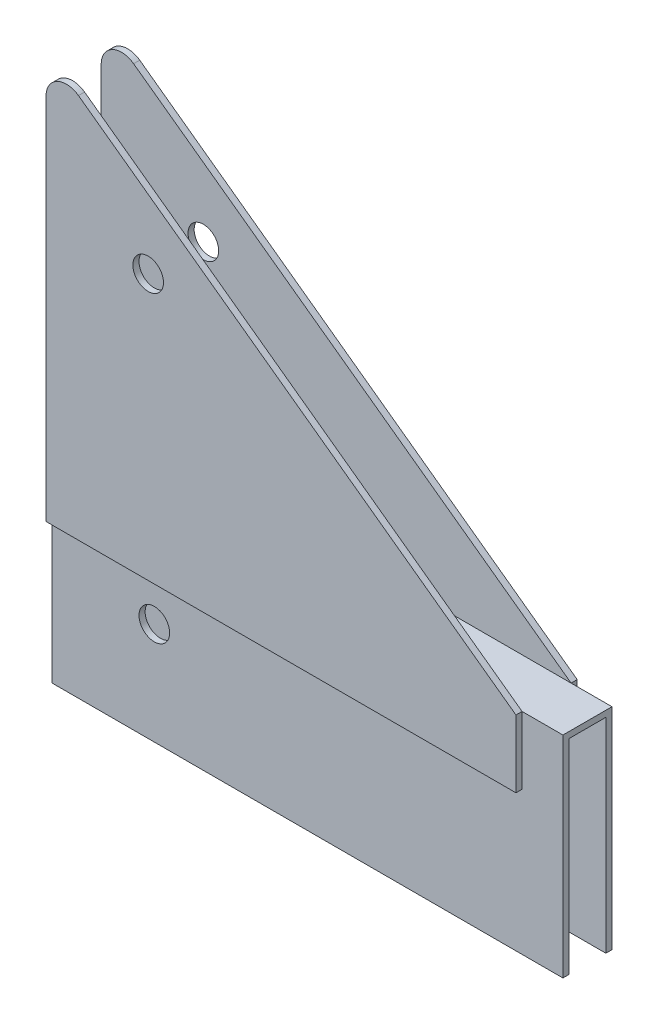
ISO-10303-21;
HEADER;
FILE_DESCRIPTION(('STEP AP214'),'2;1');
FILE_NAME('part.step','',(''),(''),'','','');
FILE_SCHEMA(('AUTOMOTIVE_DESIGN { 1 0 10303 214 1 1 1 1 }'));
ENDSEC;
DATA;
#1=APPLICATION_CONTEXT('core data for automotive mechanical design processes');
#2=APPLICATION_PROTOCOL_DEFINITION('international standard','automotive_design',2000,#1);
#3=PRODUCT_CONTEXT('',#1,'mechanical');
#4=PRODUCT('Part','Part','',(#3));
#5=PRODUCT_RELATED_PRODUCT_CATEGORY('part','',(#4));
#6=PRODUCT_DEFINITION_FORMATION('','',#4);
#7=PRODUCT_DEFINITION_CONTEXT('part definition',#1,'design');
#8=PRODUCT_DEFINITION('design','',#6,#7);
#9=PRODUCT_DEFINITION_SHAPE('','',#8);
#10=(LENGTH_UNIT() NAMED_UNIT(*) SI_UNIT(.MILLI.,.METRE.));
#11=(NAMED_UNIT(*) PLANE_ANGLE_UNIT() SI_UNIT($,.RADIAN.));
#12=(NAMED_UNIT(*) SI_UNIT($,.STERADIAN.) SOLID_ANGLE_UNIT());
#13=UNCERTAINTY_MEASURE_WITH_UNIT(LENGTH_MEASURE(1.E-05),#10,'distance_accuracy_value','');
#14=(GEOMETRIC_REPRESENTATION_CONTEXT(3) GLOBAL_UNCERTAINTY_ASSIGNED_CONTEXT((#13)) GLOBAL_UNIT_ASSIGNED_CONTEXT((#10,
#11,#12)) REPRESENTATION_CONTEXT('',''));
#15=CARTESIAN_POINT('',(0.,0.,0.));
#16=DIRECTION('',(0.,0.,1.));
#17=DIRECTION('',(1.,0.,0.));
#18=AXIS2_PLACEMENT_3D('',#15,#16,#17);
#19=CARTESIAN_POINT('',(250.,0.,3.));
#20=DIRECTION('',(0.,0.,-1.));
#21=DIRECTION('',(-1.,0.,0.));
#22=AXIS2_PLACEMENT_3D('',#19,#20,#21);
#23=PLANE('',#22);
#24=CARTESIAN_POINT('',(50.,50.,3.));
#25=DIRECTION('',(0.,0.,-1.));
#26=DIRECTION('',(-1.,0.,0.));
#27=AXIS2_PLACEMENT_3D('',#24,#25,#26);
#28=CIRCLE('',#27,7.5);
#29=CARTESIAN_POINT('',(42.5,50.,3.));
#30=VERTEX_POINT('',#29);
#31=EDGE_CURVE('E192',#30,#30,#28,.T.);
#32=ORIENTED_EDGE('',*,*,#31,.T.);
#33=EDGE_LOOP('',(#32));
#34=FACE_BOUND('',#33,.T.);
#35=DIRECTION('',(1.,0.,0.));
#36=VECTOR('',#35,1.);
#37=CARTESIAN_POINT('',(230.,70.,3.));
#38=LINE('',#37,#36);
#39=CARTESIAN_POINT('',(0.,70.,3.));
#40=VERTEX_POINT('',#39);
#41=CARTESIAN_POINT('',(230.,70.,3.));
#42=VERTEX_POINT('',#41);
#43=EDGE_CURVE('E181',#40,#42,#38,.T.);
#44=ORIENTED_EDGE('',*,*,#43,.F.);
#45=DIRECTION('',(0.,-1.,0.));
#46=VECTOR('',#45,1.);
#47=CARTESIAN_POINT('',(0.,0.,3.));
#48=LINE('',#47,#46);
#49=CARTESIAN_POINT('',(0.,0.,3.));
#50=VERTEX_POINT('',#49);
#51=EDGE_CURVE('E239',#40,#50,#48,.T.);
#52=ORIENTED_EDGE('',*,*,#51,.T.);
#53=DIRECTION('',(-1.,0.,0.));
#54=VECTOR('',#53,1.);
#55=CARTESIAN_POINT('',(250.,0.,3.));
#56=LINE('',#55,#54);
#57=CARTESIAN_POINT('',(250.,0.,3.));
#58=VERTEX_POINT('',#57);
#59=EDGE_CURVE('E253',#58,#50,#56,.T.);
#60=ORIENTED_EDGE('',*,*,#59,.F.);
#61=DIRECTION('',(0.,-1.,0.));
#62=VECTOR('',#61,1.);
#63=CARTESIAN_POINT('',(250.,0.,3.));
#64=LINE('',#63,#62);
#65=CARTESIAN_POINT('',(250.,103.,3.));
#66=VERTEX_POINT('',#65);
#67=EDGE_CURVE('E251',#66,#58,#64,.T.);
#68=ORIENTED_EDGE('',*,*,#67,.F.);
#69=DIRECTION('',(-1.,0.,0.));
#70=VECTOR('',#69,1.);
#71=CARTESIAN_POINT('',(250.,103.,3.));
#72=LINE('',#71,#70);
#73=CARTESIAN_POINT('',(230.,103.,3.));
#74=VERTEX_POINT('',#73);
#75=EDGE_CURVE('E272',#66,#74,#72,.T.);
#76=ORIENTED_EDGE('',*,*,#75,.T.);
#77=DIRECTION('',(0.,1.,0.));
#78=VECTOR('',#77,1.);
#79=CARTESIAN_POINT('',(230.,103.,3.));
#80=LINE('',#79,#78);
#81=EDGE_CURVE('E219',#42,#74,#80,.T.);
#82=ORIENTED_EDGE('',*,*,#81,.F.);
#83=EDGE_LOOP('',(#44,#52,#60,#68,#76,#82));
#84=FACE_BOUND('',#83,.T.);
#85=ADVANCED_FACE('F33',(#34,#84),#23,.F.);
#86=CARTESIAN_POINT('',(250.,0.,0.));
#87=DIRECTION('',(0.,1.,0.));
#88=DIRECTION('',(0.,0.,1.));
#89=AXIS2_PLACEMENT_3D('',#86,#87,#88);
#90=PLANE('',#89);
#91=DIRECTION('',(0.,0.,-1.));
#92=VECTOR('',#91,1.);
#93=CARTESIAN_POINT('',(0.,0.,0.));
#94=LINE('',#93,#92);
#95=CARTESIAN_POINT('',(0.,0.,0.));
#96=VERTEX_POINT('',#95);
#97=EDGE_CURVE('E234',#50,#96,#94,.T.);
#98=ORIENTED_EDGE('',*,*,#97,.T.);
#99=DIRECTION('',(-1.,0.,0.));
#100=VECTOR('',#99,1.);
#101=CARTESIAN_POINT('',(250.,0.,0.));
#102=LINE('',#101,#100);
#103=CARTESIAN_POINT('',(250.,0.,0.));
#104=VERTEX_POINT('',#103);
#105=EDGE_CURVE('E288',#104,#96,#102,.T.);
#106=ORIENTED_EDGE('',*,*,#105,.F.);
#107=DIRECTION('',(0.,0.,-1.));
#108=VECTOR('',#107,1.);
#109=CARTESIAN_POINT('',(250.,0.,0.));
#110=LINE('',#109,#108);
#111=EDGE_CURVE('E235',#58,#104,#110,.T.);
#112=ORIENTED_EDGE('',*,*,#111,.F.);
#113=ORIENTED_EDGE('',*,*,#59,.T.);
#114=EDGE_LOOP('',(#98,#106,#112,#113));
#115=FACE_BOUND('',#114,.T.);
#116=ADVANCED_FACE('F328',(#115),#90,.F.);
#117=CARTESIAN_POINT('',(250.,0.,0.));
#118=DIRECTION('',(0.,0.,1.));
#119=DIRECTION('',(1.,0.,0.));
#120=AXIS2_PLACEMENT_3D('',#117,#118,#119);
#121=PLANE('',#120);
#122=CARTESIAN_POINT('',(50.,50.,0.));
#123=DIRECTION('',(0.,0.,1.));
#124=DIRECTION('',(1.,0.,0.));
#125=AXIS2_PLACEMENT_3D('',#122,#123,#124);
#126=CIRCLE('',#125,7.5);
#127=CARTESIAN_POINT('',(57.5,50.,0.));
#128=VERTEX_POINT('',#127);
#129=EDGE_CURVE('E468',#128,#128,#126,.T.);
#130=ORIENTED_EDGE('',*,*,#129,.T.);
#131=EDGE_LOOP('',(#130));
#132=FACE_BOUND('',#131,.T.);
#133=DIRECTION('',(0.,1.,0.));
#134=VECTOR('',#133,1.);
#135=CARTESIAN_POINT('',(0.,0.,0.));
#136=LINE('',#135,#134);
#137=CARTESIAN_POINT('',(0.,100.,0.));
#138=VERTEX_POINT('',#137);
#139=EDGE_CURVE('E256',#96,#138,#136,.T.);
#140=ORIENTED_EDGE('',*,*,#139,.T.);
#141=DIRECTION('',(-1.,0.,0.));
#142=VECTOR('',#141,1.);
#143=CARTESIAN_POINT('',(250.,100.,0.));
#144=LINE('',#143,#142);
#145=CARTESIAN_POINT('',(250.,100.,0.));
#146=VERTEX_POINT('',#145);
#147=EDGE_CURVE('E285',#146,#138,#144,.T.);
#148=ORIENTED_EDGE('',*,*,#147,.F.);
#149=DIRECTION('',(0.,1.,0.));
#150=VECTOR('',#149,1.);
#151=CARTESIAN_POINT('',(250.,0.,0.));
#152=LINE('',#151,#150);
#153=EDGE_CURVE('E238',#104,#146,#152,.T.);
#154=ORIENTED_EDGE('',*,*,#153,.F.);
#155=ORIENTED_EDGE('',*,*,#105,.T.);
#156=EDGE_LOOP('',(#140,#148,#154,#155));
#157=FACE_BOUND('',#156,.T.);
#158=ADVANCED_FACE('F334',(#132,#157),#121,.F.);
#159=CARTESIAN_POINT('',(250.,100.,0.));
#160=DIRECTION('',(0.,1.,0.));
#161=DIRECTION('',(0.,0.,1.));
#162=AXIS2_PLACEMENT_3D('',#159,#160,#161);
#163=PLANE('',#162);
#164=DIRECTION('',(0.,0.,-1.));
#165=VECTOR('',#164,1.);
#166=CARTESIAN_POINT('',(0.,100.,0.));
#167=LINE('',#166,#165);
#168=CARTESIAN_POINT('',(0.,100.,-18.));
#169=VERTEX_POINT('',#168);
#170=EDGE_CURVE('E258',#138,#169,#167,.T.);
#171=ORIENTED_EDGE('',*,*,#170,.T.);
#172=DIRECTION('',(-1.,0.,0.));
#173=VECTOR('',#172,1.);
#174=CARTESIAN_POINT('',(250.,100.,-18.));
#175=LINE('',#174,#173);
#176=CARTESIAN_POINT('',(250.,100.,-18.));
#177=VERTEX_POINT('',#176);
#178=EDGE_CURVE('E282',#177,#169,#175,.T.);
#179=ORIENTED_EDGE('',*,*,#178,.F.);
#180=DIRECTION('',(0.,0.,-1.));
#181=VECTOR('',#180,1.);
#182=CARTESIAN_POINT('',(250.,100.,0.));
#183=LINE('',#182,#181);
#184=EDGE_CURVE('E241',#146,#177,#183,.T.);
#185=ORIENTED_EDGE('',*,*,#184,.F.);
#186=ORIENTED_EDGE('',*,*,#147,.T.);
#187=EDGE_LOOP('',(#171,#179,#185,#186));
#188=FACE_BOUND('',#187,.T.);
#189=ADVANCED_FACE('F357',(#188),#163,.F.);
#190=CARTESIAN_POINT('',(250.,100.,-18.));
#191=DIRECTION('',(0.,0.,-1.));
#192=DIRECTION('',(0.,1.,0.));
#193=AXIS2_PLACEMENT_3D('',#190,#191,#192);
#194=PLANE('',#193);
#195=CARTESIAN_POINT('',(50.,50.,-18.));
#196=DIRECTION('',(0.,0.,-1.));
#197=DIRECTION('',(0.,1.,0.));
#198=AXIS2_PLACEMENT_3D('',#195,#196,#197);
#199=CIRCLE('',#198,7.5);
#200=CARTESIAN_POINT('',(50.,57.5,-18.));
#201=VERTEX_POINT('',#200);
#202=EDGE_CURVE('E466',#201,#201,#199,.T.);
#203=ORIENTED_EDGE('',*,*,#202,.T.);
#204=EDGE_LOOP('',(#203));
#205=FACE_BOUND('',#204,.T.);
#206=DIRECTION('',(0.,-1.,0.));
#207=VECTOR('',#206,1.);
#208=CARTESIAN_POINT('',(0.,100.,-18.));
#209=LINE('',#208,#207);
#210=CARTESIAN_POINT('',(0.,0.,-18.));
#211=VERTEX_POINT('',#210);
#212=EDGE_CURVE('E260',#169,#211,#209,.T.);
#213=ORIENTED_EDGE('',*,*,#212,.T.);
#214=DIRECTION('',(-1.,0.,0.));
#215=VECTOR('',#214,1.);
#216=CARTESIAN_POINT('',(250.,0.,-18.));
#217=LINE('',#216,#215);
#218=CARTESIAN_POINT('',(250.,0.,-18.));
#219=VERTEX_POINT('',#218);
#220=EDGE_CURVE('E279',#219,#211,#217,.T.);
#221=ORIENTED_EDGE('',*,*,#220,.F.);
#222=DIRECTION('',(0.,-1.,0.));
#223=VECTOR('',#222,1.);
#224=CARTESIAN_POINT('',(250.,100.,-18.));
#225=LINE('',#224,#223);
#226=EDGE_CURVE('E243',#177,#219,#225,.T.);
#227=ORIENTED_EDGE('',*,*,#226,.F.);
#228=ORIENTED_EDGE('',*,*,#178,.T.);
#229=EDGE_LOOP('',(#213,#221,#227,#228));
#230=FACE_BOUND('',#229,.T.);
#231=ADVANCED_FACE('F353',(#205,#230),#194,.F.);
#232=CARTESIAN_POINT('',(250.,0.,-21.));
#233=DIRECTION('',(0.,1.,0.));
#234=DIRECTION('',(0.,0.,1.));
#235=AXIS2_PLACEMENT_3D('',#232,#233,#234);
#236=PLANE('',#235);
#237=DIRECTION('',(0.,0.,-1.));
#238=VECTOR('',#237,1.);
#239=CARTESIAN_POINT('',(0.,0.,-21.));
#240=LINE('',#239,#238);
#241=CARTESIAN_POINT('',(0.,0.,-21.));
#242=VERTEX_POINT('',#241);
#243=EDGE_CURVE('E262',#211,#242,#240,.T.);
#244=ORIENTED_EDGE('',*,*,#243,.T.);
#245=DIRECTION('',(-1.,0.,0.));
#246=VECTOR('',#245,1.);
#247=CARTESIAN_POINT('',(250.,0.,-21.));
#248=LINE('',#247,#246);
#249=CARTESIAN_POINT('',(250.,0.,-21.));
#250=VERTEX_POINT('',#249);
#251=EDGE_CURVE('E277',#250,#242,#248,.T.);
#252=ORIENTED_EDGE('',*,*,#251,.F.);
#253=DIRECTION('',(0.,0.,-1.));
#254=VECTOR('',#253,1.);
#255=CARTESIAN_POINT('',(250.,0.,-21.));
#256=LINE('',#255,#254);
#257=EDGE_CURVE('E245',#219,#250,#256,.T.);
#258=ORIENTED_EDGE('',*,*,#257,.F.);
#259=ORIENTED_EDGE('',*,*,#220,.T.);
#260=EDGE_LOOP('',(#244,#252,#258,#259));
#261=FACE_BOUND('',#260,.T.);
#262=ADVANCED_FACE('F349',(#261),#236,.F.);
#263=CARTESIAN_POINT('',(250.,103.,-21.));
#264=DIRECTION('',(0.,0.,1.));
#265=DIRECTION('',(0.,-1.,0.));
#266=AXIS2_PLACEMENT_3D('',#263,#264,#265);
#267=PLANE('',#266);
#268=CARTESIAN_POINT('',(50.,50.,-21.));
#269=DIRECTION('',(0.,0.,1.));
#270=DIRECTION('',(0.,-1.,0.));
#271=AXIS2_PLACEMENT_3D('',#268,#269,#270);
#272=CIRCLE('',#271,7.5);
#273=CARTESIAN_POINT('',(50.,42.5,-21.));
#274=VERTEX_POINT('',#273);
#275=EDGE_CURVE('E37',#274,#274,#272,.T.);
#276=ORIENTED_EDGE('',*,*,#275,.T.);
#277=EDGE_LOOP('',(#276));
#278=FACE_BOUND('',#277,.T.);
#279=DIRECTION('',(0.,1.,0.));
#280=VECTOR('',#279,1.);
#281=CARTESIAN_POINT('',(0.,103.,-21.));
#282=LINE('',#281,#280);
#283=CARTESIAN_POINT('',(0.,70.,-21.));
#284=VERTEX_POINT('',#283);
#285=EDGE_CURVE('E186',#242,#284,#282,.T.);
#286=ORIENTED_EDGE('',*,*,#285,.T.);
#287=DIRECTION('',(1.,0.,0.));
#288=VECTOR('',#287,1.);
#289=CARTESIAN_POINT('',(230.,70.,-21.));
#290=LINE('',#289,#288);
#291=CARTESIAN_POINT('',(230.,70.,-21.));
#292=VERTEX_POINT('',#291);
#293=EDGE_CURVE('E172',#284,#292,#290,.T.);
#294=ORIENTED_EDGE('',*,*,#293,.T.);
#295=DIRECTION('',(0.,1.,0.));
#296=VECTOR('',#295,1.);
#297=CARTESIAN_POINT('',(230.,103.,-21.));
#298=LINE('',#297,#296);
#299=CARTESIAN_POINT('',(230.,103.,-21.));
#300=VERTEX_POINT('',#299);
#301=EDGE_CURVE('E159',#292,#300,#298,.T.);
#302=ORIENTED_EDGE('',*,*,#301,.T.);
#303=DIRECTION('',(-1.,0.,0.));
#304=VECTOR('',#303,1.);
#305=CARTESIAN_POINT('',(250.,103.,-21.));
#306=LINE('',#305,#304);
#307=CARTESIAN_POINT('',(250.,103.,-21.));
#308=VERTEX_POINT('',#307);
#309=EDGE_CURVE('E275',#308,#300,#306,.T.);
#310=ORIENTED_EDGE('',*,*,#309,.F.);
#311=DIRECTION('',(0.,1.,0.));
#312=VECTOR('',#311,1.);
#313=CARTESIAN_POINT('',(250.,103.,-21.));
#314=LINE('',#313,#312);
#315=EDGE_CURVE('E247',#250,#308,#314,.T.);
#316=ORIENTED_EDGE('',*,*,#315,.F.);
#317=ORIENTED_EDGE('',*,*,#251,.T.);
#318=EDGE_LOOP('',(#286,#294,#302,#310,#316,#317));
#319=FACE_BOUND('',#318,.T.);
#320=ADVANCED_FACE('F183',(#278,#319),#267,.F.);
#321=CARTESIAN_POINT('',(250.,103.,3.));
#322=DIRECTION('',(0.,-1.,0.));
#323=DIRECTION('',(0.,0.,-1.));
#324=AXIS2_PLACEMENT_3D('',#321,#322,#323);
#325=PLANE('',#324);
#326=DIRECTION('',(0.,0.,1.));
#327=VECTOR('',#326,1.);
#328=CARTESIAN_POINT('',(0.,103.,3.));
#329=LINE('',#328,#327);
#330=CARTESIAN_POINT('',(0.,103.,-21.));
#331=VERTEX_POINT('',#330);
#332=CARTESIAN_POINT('',(0.,103.,3.));
#333=VERTEX_POINT('',#332);
#334=EDGE_CURVE('E265',#331,#333,#329,.T.);
#335=ORIENTED_EDGE('',*,*,#334,.T.);
#336=EDGE_CURVE('E271',#74,#333,#72,.T.);
#337=ORIENTED_EDGE('',*,*,#336,.F.);
#338=ORIENTED_EDGE('',*,*,#75,.F.);
#339=DIRECTION('',(0.,0.,1.));
#340=VECTOR('',#339,1.);
#341=CARTESIAN_POINT('',(250.,103.,3.));
#342=LINE('',#341,#340);
#343=EDGE_CURVE('E249',#308,#66,#342,.T.);
#344=ORIENTED_EDGE('',*,*,#343,.F.);
#345=ORIENTED_EDGE('',*,*,#309,.T.);
#346=EDGE_CURVE('E274',#300,#331,#306,.T.);
#347=ORIENTED_EDGE('',*,*,#346,.T.);
#348=EDGE_LOOP('',(#335,#337,#338,#344,#345,#347));
#349=FACE_BOUND('',#348,.T.);
#350=ADVANCED_FACE('F342',(#349),#325,.F.);
#351=CARTESIAN_POINT('',(250.,0.,0.));
#352=DIRECTION('',(-1.,0.,0.));
#353=DIRECTION('',(0.,0.,1.));
#354=AXIS2_PLACEMENT_3D('',#351,#352,#353);
#355=PLANE('',#354);
#356=ORIENTED_EDGE('',*,*,#111,.T.);
#357=ORIENTED_EDGE('',*,*,#153,.T.);
#358=ORIENTED_EDGE('',*,*,#184,.T.);
#359=ORIENTED_EDGE('',*,*,#226,.T.);
#360=ORIENTED_EDGE('',*,*,#257,.T.);
#361=ORIENTED_EDGE('',*,*,#315,.T.);
#362=ORIENTED_EDGE('',*,*,#343,.T.);
#363=ORIENTED_EDGE('',*,*,#67,.T.);
#364=EDGE_LOOP('',(#356,#357,#358,#359,#360,#361,#362,#363));
#365=FACE_BOUND('',#364,.T.);
#366=ADVANCED_FACE('F345',(#365),#355,.F.);
#367=CARTESIAN_POINT('',(0.,0.,0.));
#368=DIRECTION('',(-1.,0.,0.));
#369=DIRECTION('',(0.,0.,1.));
#370=AXIS2_PLACEMENT_3D('',#367,#368,#369);
#371=PLANE('',#370);
#372=DIRECTION('',(0.,-1.,0.));
#373=VECTOR('',#372,1.);
#374=CARTESIAN_POINT('',(0.,70.,-21.));
#375=LINE('',#374,#373);
#376=CARTESIAN_POINT('',(0.,250.381127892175,-21.));
#377=VERTEX_POINT('',#376);
#378=EDGE_CURVE('E196',#377,#331,#375,.T.);
#379=ORIENTED_EDGE('',*,*,#378,.F.);
#380=DIRECTION('',(0.,0.,-1.));
#381=VECTOR('',#380,1.);
#382=CARTESIAN_POINT('',(0.,250.381127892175,-24.));
#383=LINE('',#382,#381);
#384=CARTESIAN_POINT('',(0.,250.381127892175,-24.));
#385=VERTEX_POINT('',#384);
#386=EDGE_CURVE('E300',#377,#385,#383,.T.);
#387=ORIENTED_EDGE('',*,*,#386,.T.);
#388=DIRECTION('',(0.,-1.,0.));
#389=VECTOR('',#388,1.);
#390=CARTESIAN_POINT('',(0.,70.,-24.));
#391=LINE('',#390,#389);
#392=CARTESIAN_POINT('',(0.,70.,-24.));
#393=VERTEX_POINT('',#392);
#394=EDGE_CURVE('E187',#385,#393,#391,.T.);
#395=ORIENTED_EDGE('',*,*,#394,.T.);
#396=DIRECTION('',(0.,0.,-1.));
#397=VECTOR('',#396,1.);
#398=CARTESIAN_POINT('',(0.,70.,-21.));
#399=LINE('',#398,#397);
#400=EDGE_CURVE('E198',#284,#393,#399,.T.);
#401=ORIENTED_EDGE('',*,*,#400,.F.);
#402=ORIENTED_EDGE('',*,*,#285,.F.);
#403=ORIENTED_EDGE('',*,*,#243,.F.);
#404=ORIENTED_EDGE('',*,*,#212,.F.);
#405=ORIENTED_EDGE('',*,*,#170,.F.);
#406=ORIENTED_EDGE('',*,*,#139,.F.);
#407=ORIENTED_EDGE('',*,*,#97,.F.);
#408=ORIENTED_EDGE('',*,*,#51,.F.);
#409=DIRECTION('',(0.,0.,-1.));
#410=VECTOR('',#409,1.);
#411=CARTESIAN_POINT('',(0.,70.,6.));
#412=LINE('',#411,#410);
#413=CARTESIAN_POINT('',(0.,70.,6.));
#414=VERTEX_POINT('',#413);
#415=EDGE_CURVE('E216',#414,#40,#412,.T.);
#416=ORIENTED_EDGE('',*,*,#415,.F.);
#417=DIRECTION('',(0.,-1.,0.));
#418=VECTOR('',#417,1.);
#419=CARTESIAN_POINT('',(0.,70.,6.));
#420=LINE('',#419,#418);
#421=CARTESIAN_POINT('',(0.,250.381127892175,6.));
#422=VERTEX_POINT('',#421);
#423=EDGE_CURVE('E214',#422,#414,#420,.T.);
#424=ORIENTED_EDGE('',*,*,#423,.F.);
#425=DIRECTION('',(0.,0.,-1.));
#426=VECTOR('',#425,1.);
#427=CARTESIAN_POINT('',(0.,250.381127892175,3.));
#428=LINE('',#427,#426);
#429=CARTESIAN_POINT('',(0.,250.381127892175,3.));
#430=VERTEX_POINT('',#429);
#431=EDGE_CURVE('E291',#422,#430,#428,.T.);
#432=ORIENTED_EDGE('',*,*,#431,.T.);
#433=DIRECTION('',(0.,-1.,0.));
#434=VECTOR('',#433,1.);
#435=CARTESIAN_POINT('',(0.,70.,3.));
#436=LINE('',#435,#434);
#437=EDGE_CURVE('E209',#430,#333,#436,.T.);
#438=ORIENTED_EDGE('',*,*,#437,.T.);
#439=ORIENTED_EDGE('',*,*,#334,.F.);
#440=EDGE_LOOP('',(#379,#387,#395,#401,#402,#403,#404,#405,#406,#407,#408,#416,#424,#432,#438,#439));
#441=FACE_BOUND('',#440,.T.);
#442=ADVANCED_FACE('F307',(#441),#371,.T.);
#443=CARTESIAN_POINT('',(230.,70.,6.));
#444=DIRECTION('',(0.,1.,0.));
#445=DIRECTION('',(-1.,0.,0.));
#446=AXIS2_PLACEMENT_3D('',#443,#444,#445);
#447=PLANE('',#446);
#448=ORIENTED_EDGE('',*,*,#43,.T.);
#449=DIRECTION('',(0.,0.,-1.));
#450=VECTOR('',#449,1.);
#451=CARTESIAN_POINT('',(230.,70.,6.));
#452=LINE('',#451,#450);
#453=CARTESIAN_POINT('',(230.,70.,6.));
#454=VERTEX_POINT('',#453);
#455=EDGE_CURVE('E231',#454,#42,#452,.T.);
#456=ORIENTED_EDGE('',*,*,#455,.F.);
#457=DIRECTION('',(1.,0.,0.));
#458=VECTOR('',#457,1.);
#459=CARTESIAN_POINT('',(230.,70.,6.));
#460=LINE('',#459,#458);
#461=EDGE_CURVE('E205',#414,#454,#460,.T.);
#462=ORIENTED_EDGE('',*,*,#461,.F.);
#463=ORIENTED_EDGE('',*,*,#415,.T.);
#464=EDGE_LOOP('',(#448,#456,#462,#463));
#465=FACE_BOUND('',#464,.T.);
#466=ADVANCED_FACE('F389',(#465),#447,.F.);
#467=CARTESIAN_POINT('',(230.,103.,6.));
#468=DIRECTION('',(-1.,0.,0.));
#469=DIRECTION('',(0.,0.,1.));
#470=AXIS2_PLACEMENT_3D('',#467,#468,#469);
#471=PLANE('',#470);
#472=ORIENTED_EDGE('',*,*,#81,.T.);
#473=DIRECTION('',(0.,0.,-1.));
#474=VECTOR('',#473,1.);
#475=CARTESIAN_POINT('',(230.,103.,6.));
#476=LINE('',#475,#474);
#477=CARTESIAN_POINT('',(230.,103.,6.));
#478=VERTEX_POINT('',#477);
#479=EDGE_CURVE('E228',#478,#74,#476,.T.);
#480=ORIENTED_EDGE('',*,*,#479,.F.);
#481=DIRECTION('',(0.,1.,0.));
#482=VECTOR('',#481,1.);
#483=CARTESIAN_POINT('',(230.,103.,6.));
#484=LINE('',#483,#482);
#485=EDGE_CURVE('E208',#454,#478,#484,.T.);
#486=ORIENTED_EDGE('',*,*,#485,.F.);
#487=ORIENTED_EDGE('',*,*,#455,.T.);
#488=EDGE_LOOP('',(#472,#480,#486,#487));
#489=FACE_BOUND('',#488,.T.);
#490=ADVANCED_FACE('F392',(#489),#471,.F.);
#491=CARTESIAN_POINT('',(0.,270.,6.));
#492=DIRECTION('',(-0.58754394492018,-0.809192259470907,0.));
#493=DIRECTION('',(0.809192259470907,-0.58754394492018,0.));
#494=AXIS2_PLACEMENT_3D('',#491,#492,#493);
#495=PLANE('',#494);
#496=DIRECTION('',(-0.809192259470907,0.58754394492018,0.));
#497=VECTOR('',#496,1.);
#498=CARTESIAN_POINT('',(0.,270.,3.));
#499=LINE('',#498,#497);
#500=CARTESIAN_POINT('',(15.8754394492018,258.473050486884,3.));
#501=VERTEX_POINT('',#500);
#502=EDGE_CURVE('E222',#74,#501,#499,.T.);
#503=ORIENTED_EDGE('',*,*,#502,.T.);
#504=DIRECTION('',(0.,0.,-1.));
#505=VECTOR('',#504,1.);
#506=CARTESIAN_POINT('',(15.8754394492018,258.473050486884,6.));
#507=LINE('',#506,#505);
#508=CARTESIAN_POINT('',(15.8754394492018,258.473050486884,6.));
#509=VERTEX_POINT('',#508);
#510=EDGE_CURVE('E296',#501,#509,#507,.F.);
#511=ORIENTED_EDGE('',*,*,#510,.T.);
#512=DIRECTION('',(-0.809192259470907,0.58754394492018,0.));
#513=VECTOR('',#512,1.);
#514=CARTESIAN_POINT('',(0.,270.,6.));
#515=LINE('',#514,#513);
#516=EDGE_CURVE('E211',#478,#509,#515,.T.);
#517=ORIENTED_EDGE('',*,*,#516,.F.);
#518=ORIENTED_EDGE('',*,*,#479,.T.);
#519=EDGE_LOOP('',(#503,#511,#517,#518));
#520=FACE_BOUND('',#519,.T.);
#521=ADVANCED_FACE('F395',(#520),#495,.F.);
#522=CARTESIAN_POINT('',(0.,0.,6.));
#523=DIRECTION('',(0.,0.,-1.));
#524=DIRECTION('',(-1.,0.,0.));
#525=AXIS2_PLACEMENT_3D('',#522,#523,#524);
#526=PLANE('',#525);
#527=CARTESIAN_POINT('',(50.,200.,6.));
#528=DIRECTION('',(0.,0.,1.));
#529=DIRECTION('',(1.,0.,0.));
#530=AXIS2_PLACEMENT_3D('',#527,#528,#529);
#531=CIRCLE('',#530,7.5);
#532=CARTESIAN_POINT('',(57.5,200.,6.));
#533=VERTEX_POINT('',#532);
#534=EDGE_CURVE('E456',#533,#533,#531,.T.);
#535=ORIENTED_EDGE('',*,*,#534,.F.);
#536=EDGE_LOOP('',(#535));
#537=FACE_BOUND('',#536,.T.);
#538=ORIENTED_EDGE('',*,*,#516,.T.);
#539=CARTESIAN_POINT('',(10.,250.381127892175,6.));
#540=DIRECTION('',(0.,0.,-1.));
#541=DIRECTION('',(-1.,0.,0.));
#542=AXIS2_PLACEMENT_3D('',#539,#540,#541);
#543=CIRCLE('',#542,10.);
#544=EDGE_CURVE('E298',#509,#422,#543,.F.);
#545=ORIENTED_EDGE('',*,*,#544,.T.);
#546=ORIENTED_EDGE('',*,*,#423,.T.);
#547=ORIENTED_EDGE('',*,*,#461,.T.);
#548=ORIENTED_EDGE('',*,*,#485,.T.);
#549=EDGE_LOOP('',(#538,#545,#546,#547,#548));
#550=FACE_BOUND('',#549,.T.);
#551=ADVANCED_FACE('F373',(#537,#550),#526,.F.);
#552=CARTESIAN_POINT('',(0.,0.,3.));
#553=DIRECTION('',(0.,0.,-1.));
#554=DIRECTION('',(-1.,0.,0.));
#555=AXIS2_PLACEMENT_3D('',#552,#553,#554);
#556=PLANE('',#555);
#557=CARTESIAN_POINT('',(50.,200.,3.));
#558=DIRECTION('',(0.,0.,-1.));
#559=DIRECTION('',(-1.,0.,0.));
#560=AXIS2_PLACEMENT_3D('',#557,#558,#559);
#561=CIRCLE('',#560,7.5);
#562=CARTESIAN_POINT('',(42.5,200.,3.));
#563=VERTEX_POINT('',#562);
#564=EDGE_CURVE('E453',#563,#563,#561,.T.);
#565=ORIENTED_EDGE('',*,*,#564,.F.);
#566=EDGE_LOOP('',(#565));
#567=FACE_BOUND('',#566,.T.);
#568=ORIENTED_EDGE('',*,*,#437,.F.);
#569=CARTESIAN_POINT('',(10.,250.381127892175,3.));
#570=DIRECTION('',(0.,0.,-1.));
#571=DIRECTION('',(-1.,0.,0.));
#572=AXIS2_PLACEMENT_3D('',#569,#570,#571);
#573=CIRCLE('',#572,10.);
#574=EDGE_CURVE('E294',#430,#501,#573,.T.);
#575=ORIENTED_EDGE('',*,*,#574,.T.);
#576=ORIENTED_EDGE('',*,*,#502,.F.);
#577=ORIENTED_EDGE('',*,*,#336,.T.);
#578=EDGE_LOOP('',(#568,#575,#576,#577));
#579=FACE_BOUND('',#578,.T.);
#580=ADVANCED_FACE('F366',(#567,#579),#556,.T.);
#581=CARTESIAN_POINT('',(10.,250.381127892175,0.));
#582=DIRECTION('',(0.,0.,1.));
#583=DIRECTION('',(1.,0.,0.));
#584=AXIS2_PLACEMENT_3D('',#581,#582,#583);
#585=CYLINDRICAL_SURFACE('',#584,10.);
#586=ORIENTED_EDGE('',*,*,#544,.F.);
#587=ORIENTED_EDGE('',*,*,#510,.F.);
#588=ORIENTED_EDGE('',*,*,#574,.F.);
#589=ORIENTED_EDGE('',*,*,#431,.F.);
#590=EDGE_LOOP('',(#586,#587,#588,#589));
#591=FACE_BOUND('',#590,.T.);
#592=ADVANCED_FACE('F364',(#591),#585,.T.);
#593=CARTESIAN_POINT('',(230.,70.,-21.));
#594=DIRECTION('',(0.,1.,0.));
#595=DIRECTION('',(-1.,0.,0.));
#596=AXIS2_PLACEMENT_3D('',#593,#594,#595);
#597=PLANE('',#596);
#598=DIRECTION('',(1.,0.,0.));
#599=VECTOR('',#598,1.);
#600=CARTESIAN_POINT('',(230.,70.,-24.));
#601=LINE('',#600,#599);
#602=CARTESIAN_POINT('',(230.,70.,-24.));
#603=VERTEX_POINT('',#602);
#604=EDGE_CURVE('E180',#393,#603,#601,.T.);
#605=ORIENTED_EDGE('',*,*,#604,.T.);
#606=DIRECTION('',(0.,0.,-1.));
#607=VECTOR('',#606,1.);
#608=CARTESIAN_POINT('',(230.,70.,-21.));
#609=LINE('',#608,#607);
#610=EDGE_CURVE('E162',#292,#603,#609,.T.);
#611=ORIENTED_EDGE('',*,*,#610,.F.);
#612=ORIENTED_EDGE('',*,*,#293,.F.);
#613=ORIENTED_EDGE('',*,*,#400,.T.);
#614=EDGE_LOOP('',(#605,#611,#612,#613));
#615=FACE_BOUND('',#614,.T.);
#616=ADVANCED_FACE('F176',(#615),#597,.F.);
#617=CARTESIAN_POINT('',(230.,103.,-21.));
#618=DIRECTION('',(-1.,0.,0.));
#619=DIRECTION('',(0.,0.,1.));
#620=AXIS2_PLACEMENT_3D('',#617,#618,#619);
#621=PLANE('',#620);
#622=DIRECTION('',(0.,1.,0.));
#623=VECTOR('',#622,1.);
#624=CARTESIAN_POINT('',(230.,103.,-24.));
#625=LINE('',#624,#623);
#626=CARTESIAN_POINT('',(230.,103.,-24.));
#627=VERTEX_POINT('',#626);
#628=EDGE_CURVE('E200',#603,#627,#625,.T.);
#629=ORIENTED_EDGE('',*,*,#628,.T.);
#630=DIRECTION('',(0.,0.,-1.));
#631=VECTOR('',#630,1.);
#632=CARTESIAN_POINT('',(230.,103.,-21.));
#633=LINE('',#632,#631);
#634=EDGE_CURVE('E165',#300,#627,#633,.T.);
#635=ORIENTED_EDGE('',*,*,#634,.F.);
#636=ORIENTED_EDGE('',*,*,#301,.F.);
#637=ORIENTED_EDGE('',*,*,#610,.T.);
#638=EDGE_LOOP('',(#629,#635,#636,#637));
#639=FACE_BOUND('',#638,.T.);
#640=ADVANCED_FACE('F161',(#639),#621,.F.);
#641=CARTESIAN_POINT('',(0.,270.,-21.));
#642=DIRECTION('',(-0.58754394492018,-0.809192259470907,0.));
#643=DIRECTION('',(0.809192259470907,-0.58754394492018,0.));
#644=AXIS2_PLACEMENT_3D('',#641,#642,#643);
#645=PLANE('',#644);
#646=DIRECTION('',(-0.809192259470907,0.58754394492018,0.));
#647=VECTOR('',#646,1.);
#648=CARTESIAN_POINT('',(0.,270.,-24.));
#649=LINE('',#648,#647);
#650=CARTESIAN_POINT('',(15.8754394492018,258.473050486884,-24.));
#651=VERTEX_POINT('',#650);
#652=EDGE_CURVE('E189',#627,#651,#649,.T.);
#653=ORIENTED_EDGE('',*,*,#652,.T.);
#654=DIRECTION('',(0.,0.,-1.));
#655=VECTOR('',#654,1.);
#656=CARTESIAN_POINT('',(15.8754394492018,258.473050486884,-21.));
#657=LINE('',#656,#655);
#658=CARTESIAN_POINT('',(15.8754394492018,258.473050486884,-21.));
#659=VERTEX_POINT('',#658);
#660=EDGE_CURVE('E42',#651,#659,#657,.F.);
#661=ORIENTED_EDGE('',*,*,#660,.T.);
#662=DIRECTION('',(-0.809192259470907,0.58754394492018,0.));
#663=VECTOR('',#662,1.);
#664=CARTESIAN_POINT('',(0.,270.,-21.));
#665=LINE('',#664,#663);
#666=EDGE_CURVE('E171',#300,#659,#665,.T.);
#667=ORIENTED_EDGE('',*,*,#666,.F.);
#668=ORIENTED_EDGE('',*,*,#634,.T.);
#669=EDGE_LOOP('',(#653,#661,#667,#668));
#670=FACE_BOUND('',#669,.T.);
#671=ADVANCED_FACE('F312',(#670),#645,.F.);
#672=CARTESIAN_POINT('',(0.,0.,-21.));
#673=DIRECTION('',(0.,0.,-1.));
#674=DIRECTION('',(-1.,0.,0.));
#675=AXIS2_PLACEMENT_3D('',#672,#673,#674);
#676=PLANE('',#675);
#677=CARTESIAN_POINT('',(50.,200.,-21.));
#678=DIRECTION('',(0.,0.,-1.));
#679=DIRECTION('',(-1.,0.,0.));
#680=AXIS2_PLACEMENT_3D('',#677,#678,#679);
#681=CIRCLE('',#680,7.5);
#682=CARTESIAN_POINT('',(42.5,200.,-21.));
#683=VERTEX_POINT('',#682);
#684=EDGE_CURVE('E460',#683,#683,#681,.T.);
#685=ORIENTED_EDGE('',*,*,#684,.T.);
#686=EDGE_LOOP('',(#685));
#687=FACE_BOUND('',#686,.T.);
#688=ORIENTED_EDGE('',*,*,#666,.T.);
#689=CARTESIAN_POINT('',(10.,250.381127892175,-21.));
#690=DIRECTION('',(0.,0.,-1.));
#691=DIRECTION('',(-1.,0.,0.));
#692=AXIS2_PLACEMENT_3D('',#689,#690,#691);
#693=CIRCLE('',#692,10.);
#694=EDGE_CURVE('E11',#659,#377,#693,.F.);
#695=ORIENTED_EDGE('',*,*,#694,.T.);
#696=ORIENTED_EDGE('',*,*,#378,.T.);
#697=ORIENTED_EDGE('',*,*,#346,.F.);
#698=EDGE_LOOP('',(#688,#695,#696,#697));
#699=FACE_BOUND('',#698,.T.);
#700=ADVANCED_FACE('F314',(#687,#699),#676,.F.);
#701=CARTESIAN_POINT('',(0.,0.,-24.));
#702=DIRECTION('',(0.,0.,-1.));
#703=DIRECTION('',(-1.,0.,0.));
#704=AXIS2_PLACEMENT_3D('',#701,#702,#703);
#705=PLANE('',#704);
#706=CARTESIAN_POINT('',(50.,200.,-24.));
#707=DIRECTION('',(0.,0.,1.));
#708=DIRECTION('',(1.,0.,0.));
#709=AXIS2_PLACEMENT_3D('',#706,#707,#708);
#710=CIRCLE('',#709,7.5);
#711=CARTESIAN_POINT('',(57.5,200.,-24.));
#712=VERTEX_POINT('',#711);
#713=EDGE_CURVE('E457',#712,#712,#710,.T.);
#714=ORIENTED_EDGE('',*,*,#713,.T.);
#715=EDGE_LOOP('',(#714));
#716=FACE_BOUND('',#715,.T.);
#717=ORIENTED_EDGE('',*,*,#394,.F.);
#718=CARTESIAN_POINT('',(10.,250.381127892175,-24.));
#719=DIRECTION('',(0.,0.,-1.));
#720=DIRECTION('',(-1.,0.,0.));
#721=AXIS2_PLACEMENT_3D('',#718,#719,#720);
#722=CIRCLE('',#721,10.);
#723=EDGE_CURVE('E56',#385,#651,#722,.T.);
#724=ORIENTED_EDGE('',*,*,#723,.T.);
#725=ORIENTED_EDGE('',*,*,#652,.F.);
#726=ORIENTED_EDGE('',*,*,#628,.F.);
#727=ORIENTED_EDGE('',*,*,#604,.F.);
#728=EDGE_LOOP('',(#717,#724,#725,#726,#727));
#729=FACE_BOUND('',#728,.T.);
#730=ADVANCED_FACE('F311',(#716,#729),#705,.T.);
#731=CARTESIAN_POINT('',(10.,250.381127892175,0.));
#732=DIRECTION('',(0.,0.,1.));
#733=DIRECTION('',(1.,0.,0.));
#734=AXIS2_PLACEMENT_3D('',#731,#732,#733);
#735=CYLINDRICAL_SURFACE('',#734,10.);
#736=ORIENTED_EDGE('',*,*,#694,.F.);
#737=ORIENTED_EDGE('',*,*,#660,.F.);
#738=ORIENTED_EDGE('',*,*,#723,.F.);
#739=ORIENTED_EDGE('',*,*,#386,.F.);
#740=EDGE_LOOP('',(#736,#737,#738,#739));
#741=FACE_BOUND('',#740,.T.);
#742=ADVANCED_FACE('F35',(#741),#735,.T.);
#743=CARTESIAN_POINT('',(50.,200.,-24.));
#744=DIRECTION('',(0.,0.,1.));
#745=DIRECTION('',(1.,0.,0.));
#746=AXIS2_PLACEMENT_3D('',#743,#744,#745);
#747=CYLINDRICAL_SURFACE('',#746,7.5);
#748=ORIENTED_EDGE('',*,*,#713,.F.);
#749=EDGE_LOOP('',(#748));
#750=FACE_BOUND('',#749,.T.);
#751=ORIENTED_EDGE('',*,*,#684,.F.);
#752=EDGE_LOOP('',(#751));
#753=FACE_BOUND('',#752,.T.);
#754=ADVANCED_FACE('F317',(#750,#753),#747,.F.);
#755=ORIENTED_EDGE('',*,*,#564,.T.);
#756=EDGE_LOOP('',(#755));
#757=FACE_BOUND('',#756,.T.);
#758=ORIENTED_EDGE('',*,*,#534,.T.);
#759=EDGE_LOOP('',(#758));
#760=FACE_BOUND('',#759,.T.);
#761=ADVANCED_FACE('F322',(#757,#760),#747,.F.);
#762=CARTESIAN_POINT('',(50.,50.,-24.));
#763=DIRECTION('',(0.,0.,1.));
#764=DIRECTION('',(1.,0.,0.));
#765=AXIS2_PLACEMENT_3D('',#762,#763,#764);
#766=CYLINDRICAL_SURFACE('',#765,7.5);
#767=ORIENTED_EDGE('',*,*,#275,.F.);
#768=EDGE_LOOP('',(#767));
#769=FACE_BOUND('',#768,.T.);
#770=ORIENTED_EDGE('',*,*,#202,.F.);
#771=EDGE_LOOP('',(#770));
#772=FACE_BOUND('',#771,.T.);
#773=ADVANCED_FACE('F442',(#769,#772),#766,.F.);
#774=ORIENTED_EDGE('',*,*,#129,.F.);
#775=EDGE_LOOP('',(#774));
#776=FACE_BOUND('',#775,.T.);
#777=ORIENTED_EDGE('',*,*,#31,.F.);
#778=EDGE_LOOP('',(#777));
#779=FACE_BOUND('',#778,.T.);
#780=ADVANCED_FACE('F440',(#776,#779),#766,.F.);
#781=CLOSED_SHELL('',(#85,#116,#158,#189,#231,#262,#320,#350,#366,#442,#466,#490,#521,#551,#580,
#592,#616,#640,#671,#700,#730,#742,#754,#761,#773,#780));
#782=MANIFOLD_SOLID_BREP('B2',#781);
#783=ADVANCED_BREP_SHAPE_REPRESENTATION('',(#18,#782),#14);
#784=SHAPE_DEFINITION_REPRESENTATION(#9,#783);
ENDSEC;
END-ISO-10303-21;
